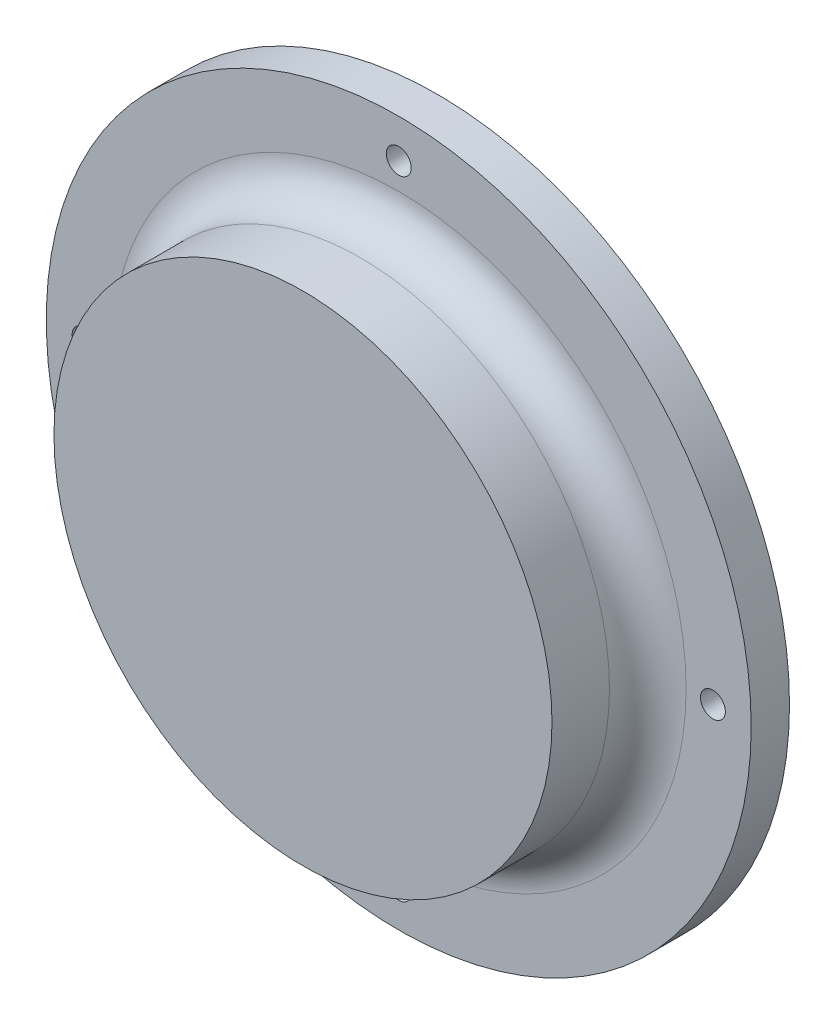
ISO-10303-21;
HEADER;
FILE_DESCRIPTION(('STEP AP214'),'2;1');
FILE_NAME('part.step','',(''),(''),'','','');
FILE_SCHEMA(('AUTOMOTIVE_DESIGN { 1 0 10303 214 1 1 1 1 }'));
ENDSEC;
DATA;
#1=APPLICATION_CONTEXT('core data for automotive mechanical design processes');
#2=APPLICATION_PROTOCOL_DEFINITION('international standard','automotive_design',2000,#1);
#3=PRODUCT_CONTEXT('',#1,'mechanical');
#4=PRODUCT('Part','Part','',(#3));
#5=PRODUCT_RELATED_PRODUCT_CATEGORY('part','',(#4));
#6=PRODUCT_DEFINITION_FORMATION('','',#4);
#7=PRODUCT_DEFINITION_CONTEXT('part definition',#1,'design');
#8=PRODUCT_DEFINITION('design','',#6,#7);
#9=PRODUCT_DEFINITION_SHAPE('','',#8);
#10=(LENGTH_UNIT() NAMED_UNIT(*) SI_UNIT(.MILLI.,.METRE.));
#11=(NAMED_UNIT(*) PLANE_ANGLE_UNIT() SI_UNIT($,.RADIAN.));
#12=(NAMED_UNIT(*) SI_UNIT($,.STERADIAN.) SOLID_ANGLE_UNIT());
#13=UNCERTAINTY_MEASURE_WITH_UNIT(LENGTH_MEASURE(1.E-05),#10,'distance_accuracy_value','');
#14=(GEOMETRIC_REPRESENTATION_CONTEXT(3) GLOBAL_UNCERTAINTY_ASSIGNED_CONTEXT((#13)) GLOBAL_UNIT_ASSIGNED_CONTEXT((#10,
#11,#12)) REPRESENTATION_CONTEXT('',''));
#15=CARTESIAN_POINT('',(0.,0.,0.));
#16=DIRECTION('',(0.,0.,1.));
#17=DIRECTION('',(1.,0.,0.));
#18=AXIS2_PLACEMENT_3D('',#15,#16,#17);
#19=CARTESIAN_POINT('',(0.,0.,10.));
#20=DIRECTION('',(0.,0.,1.));
#21=DIRECTION('',(1.,0.,0.));
#22=AXIS2_PLACEMENT_3D('',#19,#20,#21);
#23=PLANE('',#22);
#24=CARTESIAN_POINT('',(0.,0.,10.));
#25=DIRECTION('',(0.,0.,1.));
#26=DIRECTION('',(1.,0.,0.));
#27=AXIS2_PLACEMENT_3D('',#24,#25,#26);
#28=CIRCLE('',#27,75.);
#29=CARTESIAN_POINT('',(75.,0.,10.));
#30=VERTEX_POINT('',#29);
#31=EDGE_CURVE('E35',#30,#30,#28,.F.);
#32=ORIENTED_EDGE('',*,*,#31,.T.);
#33=EDGE_LOOP('',(#32));
#34=FACE_BOUND('',#33,.T.);
#35=CARTESIAN_POINT('',(0.,0.,10.));
#36=DIRECTION('',(0.,0.,1.));
#37=DIRECTION('',(1.,0.,0.));
#38=AXIS2_PLACEMENT_3D('',#35,#36,#37);
#39=CIRCLE('',#38,92.);
#40=CARTESIAN_POINT('',(92.,0.,10.));
#41=VERTEX_POINT('',#40);
#42=EDGE_CURVE('E44',#41,#41,#39,.T.);
#43=ORIENTED_EDGE('',*,*,#42,.T.);
#44=EDGE_LOOP('',(#43));
#45=FACE_BOUND('',#44,.T.);
#46=CARTESIAN_POINT('',(0.,81.9027362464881,10.));
#47=DIRECTION('',(0.,0.,1.));
#48=DIRECTION('',(1.,0.,0.));
#49=AXIS2_PLACEMENT_3D('',#46,#47,#48);
#50=CIRCLE('',#49,3.24999999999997);
#51=CARTESIAN_POINT('',(3.24999999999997,81.9027362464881,10.));
#52=VERTEX_POINT('',#51);
#53=EDGE_CURVE('E53',#52,#52,#50,.T.);
#54=ORIENTED_EDGE('',*,*,#53,.F.);
#55=EDGE_LOOP('',(#54));
#56=FACE_BOUND('',#55,.T.);
#57=CARTESIAN_POINT('',(-82.,-5.72603271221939E-13,10.));
#58=DIRECTION('',(0.,0.,1.));
#59=DIRECTION('',(1.,0.,0.));
#60=AXIS2_PLACEMENT_3D('',#57,#58,#59);
#61=CIRCLE('',#60,3.25000000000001);
#62=CARTESIAN_POINT('',(-78.75,-5.72603271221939E-13,10.));
#63=VERTEX_POINT('',#62);
#64=EDGE_CURVE('E59',#63,#63,#61,.T.);
#65=ORIENTED_EDGE('',*,*,#64,.F.);
#66=EDGE_LOOP('',(#65));
#67=FACE_BOUND('',#66,.T.);
#68=CARTESIAN_POINT('',(8.58904906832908E-13,-82.,10.));
#69=DIRECTION('',(0.,0.,1.));
#70=DIRECTION('',(1.,0.,0.));
#71=AXIS2_PLACEMENT_3D('',#68,#69,#70);
#72=CIRCLE('',#71,3.25);
#73=CARTESIAN_POINT('',(3.25000000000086,-82.,10.));
#74=VERTEX_POINT('',#73);
#75=EDGE_CURVE('E65',#74,#74,#72,.T.);
#76=ORIENTED_EDGE('',*,*,#75,.F.);
#77=EDGE_LOOP('',(#76));
#78=FACE_BOUND('',#77,.T.);
#79=CARTESIAN_POINT('',(82.,0.,10.));
#80=DIRECTION('',(0.,0.,1.));
#81=DIRECTION('',(1.,0.,0.));
#82=AXIS2_PLACEMENT_3D('',#79,#80,#81);
#83=CIRCLE('',#82,3.25000000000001);
#84=CARTESIAN_POINT('',(85.25,0.,10.));
#85=VERTEX_POINT('',#84);
#86=EDGE_CURVE('E71',#85,#85,#83,.T.);
#87=ORIENTED_EDGE('',*,*,#86,.F.);
#88=EDGE_LOOP('',(#87));
#89=FACE_BOUND('',#88,.T.);
#90=ADVANCED_FACE('F24',(#34,#45,#56,#67,#78,#89),#23,.T.);
#91=CARTESIAN_POINT('',(0.,0.,10.));
#92=DIRECTION('',(0.,0.,-1.));
#93=DIRECTION('',(-1.,0.,0.));
#94=AXIS2_PLACEMENT_3D('',#91,#92,#93);
#95=CYLINDRICAL_SURFACE('',#94,92.);
#96=ORIENTED_EDGE('',*,*,#42,.F.);
#97=EDGE_LOOP('',(#96));
#98=FACE_BOUND('',#97,.T.);
#99=CARTESIAN_POINT('',(0.,0.,0.));
#100=DIRECTION('',(0.,0.,1.));
#101=DIRECTION('',(1.,0.,0.));
#102=AXIS2_PLACEMENT_3D('',#99,#100,#101);
#103=CIRCLE('',#102,92.);
#104=CARTESIAN_POINT('',(92.,0.,0.));
#105=VERTEX_POINT('',#104);
#106=EDGE_CURVE('E47',#105,#105,#103,.T.);
#107=ORIENTED_EDGE('',*,*,#106,.T.);
#108=EDGE_LOOP('',(#107));
#109=FACE_BOUND('',#108,.T.);
#110=ADVANCED_FACE('F26',(#98,#109),#95,.T.);
#111=CARTESIAN_POINT('',(0.,0.,0.));
#112=DIRECTION('',(0.,0.,1.));
#113=DIRECTION('',(1.,0.,0.));
#114=AXIS2_PLACEMENT_3D('',#111,#112,#113);
#115=PLANE('',#114);
#116=CARTESIAN_POINT('',(0.,0.,0.));
#117=DIRECTION('',(0.,0.,1.));
#118=DIRECTION('',(1.,0.,0.));
#119=AXIS2_PLACEMENT_3D('',#116,#117,#118);
#120=CIRCLE('',#119,69.);
#121=CARTESIAN_POINT('',(69.,0.,0.));
#122=VERTEX_POINT('',#121);
#123=EDGE_CURVE('E77',#122,#122,#120,.T.);
#124=ORIENTED_EDGE('',*,*,#123,.T.);
#125=EDGE_LOOP('',(#124));
#126=FACE_BOUND('',#125,.T.);
#127=CARTESIAN_POINT('',(82.,0.,0.));
#128=DIRECTION('',(0.,0.,1.));
#129=DIRECTION('',(1.,0.,0.));
#130=AXIS2_PLACEMENT_3D('',#127,#128,#129);
#131=CIRCLE('',#130,3.25000000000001);
#132=CARTESIAN_POINT('',(85.25,0.,0.));
#133=VERTEX_POINT('',#132);
#134=EDGE_CURVE('E68',#133,#133,#131,.T.);
#135=ORIENTED_EDGE('',*,*,#134,.T.);
#136=EDGE_LOOP('',(#135));
#137=FACE_BOUND('',#136,.T.);
#138=CARTESIAN_POINT('',(8.58904906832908E-13,-82.,0.));
#139=DIRECTION('',(0.,0.,1.));
#140=DIRECTION('',(1.,0.,0.));
#141=AXIS2_PLACEMENT_3D('',#138,#139,#140);
#142=CIRCLE('',#141,3.25);
#143=CARTESIAN_POINT('',(3.25000000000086,-82.,0.));
#144=VERTEX_POINT('',#143);
#145=EDGE_CURVE('E62',#144,#144,#142,.T.);
#146=ORIENTED_EDGE('',*,*,#145,.T.);
#147=EDGE_LOOP('',(#146));
#148=FACE_BOUND('',#147,.T.);
#149=CARTESIAN_POINT('',(-82.,-5.72603271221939E-13,0.));
#150=DIRECTION('',(0.,0.,1.));
#151=DIRECTION('',(1.,0.,0.));
#152=AXIS2_PLACEMENT_3D('',#149,#150,#151);
#153=CIRCLE('',#152,3.25000000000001);
#154=CARTESIAN_POINT('',(-78.75,-5.72603271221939E-13,0.));
#155=VERTEX_POINT('',#154);
#156=EDGE_CURVE('E56',#155,#155,#153,.T.);
#157=ORIENTED_EDGE('',*,*,#156,.T.);
#158=EDGE_LOOP('',(#157));
#159=FACE_BOUND('',#158,.T.);
#160=CARTESIAN_POINT('',(0.,81.9027362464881,0.));
#161=DIRECTION('',(0.,0.,1.));
#162=DIRECTION('',(1.,0.,0.));
#163=AXIS2_PLACEMENT_3D('',#160,#161,#162);
#164=CIRCLE('',#163,3.24999999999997);
#165=CARTESIAN_POINT('',(3.24999999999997,81.9027362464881,0.));
#166=VERTEX_POINT('',#165);
#167=EDGE_CURVE('E50',#166,#166,#164,.T.);
#168=ORIENTED_EDGE('',*,*,#167,.T.);
#169=EDGE_LOOP('',(#168));
#170=FACE_BOUND('',#169,.T.);
#171=ORIENTED_EDGE('',*,*,#106,.F.);
#172=EDGE_LOOP('',(#171));
#173=FACE_BOUND('',#172,.T.);
#174=ADVANCED_FACE('F81',(#126,#137,#148,#159,#170,#173),#115,.F.);
#175=CARTESIAN_POINT('',(0.,81.9027362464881,0.));
#176=DIRECTION('',(0.,0.,1.));
#177=DIRECTION('',(1.,0.,0.));
#178=AXIS2_PLACEMENT_3D('',#175,#176,#177);
#179=CYLINDRICAL_SURFACE('',#178,3.24999999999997);
#180=ORIENTED_EDGE('',*,*,#167,.F.);
#181=EDGE_LOOP('',(#180));
#182=FACE_BOUND('',#181,.T.);
#183=ORIENTED_EDGE('',*,*,#53,.T.);
#184=EDGE_LOOP('',(#183));
#185=FACE_BOUND('',#184,.T.);
#186=ADVANCED_FACE('F110',(#182,#185),#179,.F.);
#187=CARTESIAN_POINT('',(-82.,-5.72603271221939E-13,0.));
#188=DIRECTION('',(0.,0.,1.));
#189=DIRECTION('',(1.,0.,0.));
#190=AXIS2_PLACEMENT_3D('',#187,#188,#189);
#191=CYLINDRICAL_SURFACE('',#190,3.25000000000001);
#192=ORIENTED_EDGE('',*,*,#156,.F.);
#193=EDGE_LOOP('',(#192));
#194=FACE_BOUND('',#193,.T.);
#195=ORIENTED_EDGE('',*,*,#64,.T.);
#196=EDGE_LOOP('',(#195));
#197=FACE_BOUND('',#196,.T.);
#198=ADVANCED_FACE('F113',(#194,#197),#191,.F.);
#199=CARTESIAN_POINT('',(8.58904906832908E-13,-82.,0.));
#200=DIRECTION('',(0.,0.,1.));
#201=DIRECTION('',(1.,0.,0.));
#202=AXIS2_PLACEMENT_3D('',#199,#200,#201);
#203=CYLINDRICAL_SURFACE('',#202,3.25);
#204=ORIENTED_EDGE('',*,*,#145,.F.);
#205=EDGE_LOOP('',(#204));
#206=FACE_BOUND('',#205,.T.);
#207=ORIENTED_EDGE('',*,*,#75,.T.);
#208=EDGE_LOOP('',(#207));
#209=FACE_BOUND('',#208,.T.);
#210=ADVANCED_FACE('F117',(#206,#209),#203,.F.);
#211=CARTESIAN_POINT('',(82.,0.,0.));
#212=DIRECTION('',(0.,0.,1.));
#213=DIRECTION('',(1.,0.,0.));
#214=AXIS2_PLACEMENT_3D('',#211,#212,#213);
#215=CYLINDRICAL_SURFACE('',#214,3.25000000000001);
#216=ORIENTED_EDGE('',*,*,#134,.F.);
#217=EDGE_LOOP('',(#216));
#218=FACE_BOUND('',#217,.T.);
#219=ORIENTED_EDGE('',*,*,#86,.T.);
#220=EDGE_LOOP('',(#219));
#221=FACE_BOUND('',#220,.T.);
#222=ADVANCED_FACE('F121',(#218,#221),#215,.F.);
#223=CARTESIAN_POINT('',(0.,0.,35.));
#224=DIRECTION('',(0.,0.,-1.));
#225=DIRECTION('',(-1.,0.,0.));
#226=AXIS2_PLACEMENT_3D('',#223,#224,#225);
#227=CYLINDRICAL_SURFACE('',#226,65.);
#228=CARTESIAN_POINT('',(0.,0.,20.));
#229=DIRECTION('',(0.,0.,1.));
#230=DIRECTION('',(1.,0.,0.));
#231=AXIS2_PLACEMENT_3D('',#228,#229,#230);
#232=CIRCLE('',#231,65.);
#233=CARTESIAN_POINT('',(65.,0.,20.));
#234=VERTEX_POINT('',#233);
#235=EDGE_CURVE('E39',#234,#234,#232,.T.);
#236=ORIENTED_EDGE('',*,*,#235,.T.);
#237=EDGE_LOOP('',(#236));
#238=FACE_BOUND('',#237,.T.);
#239=CARTESIAN_POINT('',(0.,0.,35.));
#240=DIRECTION('',(0.,0.,1.));
#241=DIRECTION('',(1.,0.,0.));
#242=AXIS2_PLACEMENT_3D('',#239,#240,#241);
#243=CIRCLE('',#242,65.);
#244=CARTESIAN_POINT('',(65.,0.,35.));
#245=VERTEX_POINT('',#244);
#246=EDGE_CURVE('E74',#245,#245,#243,.T.);
#247=ORIENTED_EDGE('',*,*,#246,.F.);
#248=EDGE_LOOP('',(#247));
#249=FACE_BOUND('',#248,.T.);
#250=ADVANCED_FACE('F125',(#238,#249),#227,.T.);
#251=CARTESIAN_POINT('',(0.,0.,35.));
#252=DIRECTION('',(0.,0.,1.));
#253=DIRECTION('',(1.,0.,0.));
#254=AXIS2_PLACEMENT_3D('',#251,#252,#253);
#255=PLANE('',#254);
#256=ORIENTED_EDGE('',*,*,#246,.T.);
#257=EDGE_LOOP('',(#256));
#258=FACE_BOUND('',#257,.T.);
#259=ADVANCED_FACE('F96',(#258),#255,.T.);
#260=CARTESIAN_POINT('',(0.,0.,20.));
#261=DIRECTION('',(0.,0.,1.));
#262=DIRECTION('',(1.,0.,0.));
#263=AXIS2_PLACEMENT_3D('',#260,#261,#262);
#264=TOROIDAL_SURFACE('',#263,75.,10.);
#265=ORIENTED_EDGE('',*,*,#31,.F.);
#266=EDGE_LOOP('',(#265));
#267=FACE_BOUND('',#266,.T.);
#268=ORIENTED_EDGE('',*,*,#235,.F.);
#269=EDGE_LOOP('',(#268));
#270=FACE_BOUND('',#269,.T.);
#271=ADVANCED_FACE('F87',(#267,#270),#264,.F.);
#272=CARTESIAN_POINT('',(0.,0.,-7.));
#273=DIRECTION('',(0.,0.,1.));
#274=DIRECTION('',(1.,0.,0.));
#275=AXIS2_PLACEMENT_3D('',#272,#273,#274);
#276=CYLINDRICAL_SURFACE('',#275,69.);
#277=CARTESIAN_POINT('',(0.,0.,-5.49999999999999));
#278=DIRECTION('',(0.,0.,1.));
#279=DIRECTION('',(1.,0.,0.));
#280=AXIS2_PLACEMENT_3D('',#277,#278,#279);
#281=CIRCLE('',#280,69.);
#282=CARTESIAN_POINT('',(69.,0.,-5.49999999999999));
#283=VERTEX_POINT('',#282);
#284=EDGE_CURVE('E31',#283,#283,#281,.T.);
#285=ORIENTED_EDGE('',*,*,#284,.T.);
#286=EDGE_LOOP('',(#285));
#287=FACE_BOUND('',#286,.T.);
#288=ORIENTED_EDGE('',*,*,#123,.F.);
#289=EDGE_LOOP('',(#288));
#290=FACE_BOUND('',#289,.T.);
#291=ADVANCED_FACE('F84',(#287,#290),#276,.T.);
#292=CARTESIAN_POINT('',(0.,0.,-7.));
#293=DIRECTION('',(0.,0.,1.));
#294=DIRECTION('',(1.,0.,0.));
#295=AXIS2_PLACEMENT_3D('',#292,#293,#294);
#296=PLANE('',#295);
#297=CARTESIAN_POINT('',(0.,0.,-7.));
#298=DIRECTION('',(0.,0.,1.));
#299=DIRECTION('',(1.,0.,0.));
#300=AXIS2_PLACEMENT_3D('',#297,#298,#299);
#301=CIRCLE('',#300,67.5);
#302=CARTESIAN_POINT('',(67.5,0.,-7.));
#303=VERTEX_POINT('',#302);
#304=EDGE_CURVE('E10',#303,#303,#301,.F.);
#305=ORIENTED_EDGE('',*,*,#304,.T.);
#306=EDGE_LOOP('',(#305));
#307=FACE_BOUND('',#306,.T.);
#308=ADVANCED_FACE('F86',(#307),#296,.F.);
#309=CARTESIAN_POINT('',(0.,0.,-5.49999999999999));
#310=DIRECTION('',(0.,0.,1.));
#311=DIRECTION('',(1.,0.,0.));
#312=AXIS2_PLACEMENT_3D('',#309,#310,#311);
#313=CONICAL_SURFACE('',#312,69.,0.785398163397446);
#314=ORIENTED_EDGE('',*,*,#304,.F.);
#315=EDGE_LOOP('',(#314));
#316=FACE_BOUND('',#315,.T.);
#317=ORIENTED_EDGE('',*,*,#284,.F.);
#318=EDGE_LOOP('',(#317));
#319=FACE_BOUND('',#318,.T.);
#320=ADVANCED_FACE('F93',(#316,#319),#313,.T.);
#321=CLOSED_SHELL('',(#90,#110,#174,#186,#198,#210,#222,#250,#259,#271,#291,#308,#320));
#322=MANIFOLD_SOLID_BREP('B2',#321);
#323=ADVANCED_BREP_SHAPE_REPRESENTATION('',(#18,#322),#14);
#324=SHAPE_DEFINITION_REPRESENTATION(#9,#323);
ENDSEC;
END-ISO-10303-21;
